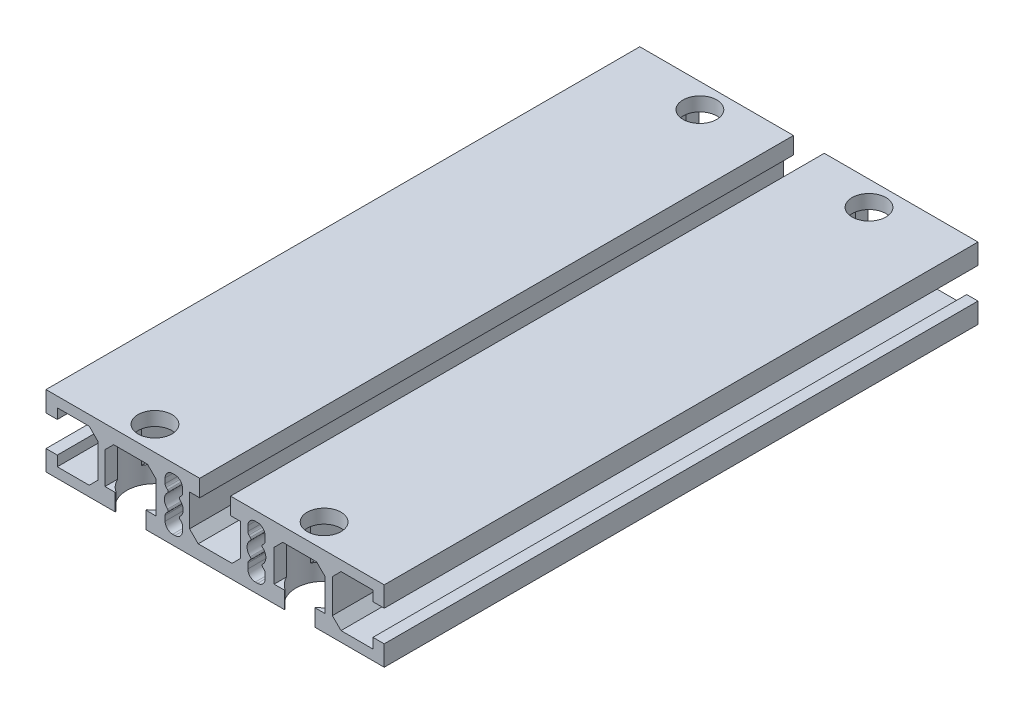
from build123d import *

# Parameters (mm, degrees)
BOSS_EXTRUDE1_DEPTH                     = 79
BOSS_EXTRUDE1_DEPTH_BACK                = 79
CBORE_FOR_M8_HEX_HEAD_BOLT1_D           = 9
CBORE_FOR_M8_HEX_HEAD_BOLT1_CBORE_D     = 15
CBORE_FOR_M8_HEX_HEAD_BOLT1_CBORE_DEPTH = 15.3


with BuildPart() as part:
    # Sketch1 → Boss-Extrude1 (new, two sides: drawn at the far end of the back side and taken through both)
    with BuildSketch(Plane.XY.offset(-BOSS_EXTRUDE1_DEPTH_BACK)):
        Polygon((-15.7, 3.5), (-15.7, -5), (-18.4, -5), (-18.4, -9.5), (18.4, -9.5), (18.4, -5), (15.7, -5), (15.7, 3.5), (18, 5.8), (27, 5.8), (29.3, 3.5), (29.3, -5), (26.6, -5), (26.6, -9.5), (45, -9.5), (45, -4.1), (42, -4.1), (42, -6.8), (33.5, -6.8), (31.2, -4.5), (31.2, 4.5), (33.5, 6.8), (42, 6.8), (42, 4.1), (45, 4.1), (45, 9.5), (4.1, 9.5), (4.1, 5), (6.8, 5), (6.8, -3.5), (4.5, -5.8), (-4.5, -5.8), (-6.8, -3.5), (-6.8, 5), (-4.1, 5), (-4.1, 9.5), (-45, 9.5), (-45, 4.1), (-42, 4.1), (-42, 6.8), (-33.5, 6.8), (-31.2, 4.5), (-31.2, -4.5), (-33.5, -6.8), (-42, -6.8), (-42, -4.1), (-45, -4.1), (-45, -9.5), (-26.6, -9.5), (-26.6, -5), (-29.3, -5), (-29.3, 3.5), (-27, 5.8), (-18, 5.8), align=None)
        with BuildLine():
            Line((-13.299970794, -4.999975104), (-13.299970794, -3.657373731))
            ThreePointArc((-13.299970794, -3.657373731), (-13.223850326, -3.274690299), (-13.007077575, -2.95026695))
            Line((-13.007077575, -2.95026695), (-12.646417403, -2.589606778))
            ThreePointArc((-12.646417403, -2.589606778), (-12.500164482, -2.222137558), (-12.66663746, -1.863375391))
            ThreePointArc((-12.66663746, -1.863375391), (-13.499970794, 1.459e-05), (-12.66663746, 1.863404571))
            ThreePointArc((-12.66663746, 1.863404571), (-12.500164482, 2.222166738), (-12.646417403, 2.589635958))
            Line((-12.646417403, 2.589635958), (-13.007077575, 2.95029613))
            ThreePointArc((-13.007077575, 2.95029613), (-13.223850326, 3.274719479), (-13.299970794, 3.657402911))
            Line((-13.299970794, 3.657402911), (-13.299970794, 5.000004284))
            ThreePointArc((-13.299970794, 5.000004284), (-12.714184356, 6.414217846), (-11.299970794, 7.000004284))
            Line((-11.299970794, 7.000004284), (-10.699970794, 7.000004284))
            ThreePointArc((-10.699970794, 7.000004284), (-9.285757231, 6.414217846), (-8.699970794, 5.000004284))
            Line((-8.699970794, 5.000004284), (-8.699970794, 3.657402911))
            ThreePointArc((-8.699970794, 3.657402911), (-8.776091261, 3.274719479), (-8.992864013, 2.95029613))
            Line((-8.992864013, 2.95029613), (-9.353524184, 2.589635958))
            ThreePointArc((-9.353524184, 2.589635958), (-9.499777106, 2.222166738), (-9.333304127, 1.863404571))
            ThreePointArc((-9.333304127, 1.863404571), (-8.499970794, 1.459e-05), (-9.333304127, -1.863375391))
            ThreePointArc((-9.333304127, -1.863375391), (-9.499777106, -2.222137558), (-9.353524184, -2.589606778))
            Line((-9.353524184, -2.589606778), (-8.992864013, -2.95026695))
            ThreePointArc((-8.992864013, -2.95026695), (-8.776091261, -3.274690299), (-8.699970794, -3.657373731))
            Line((-8.699970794, -3.657373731), (-8.699970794, -4.999975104))
            ThreePointArc((-8.699970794, -4.999975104), (-9.285757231, -6.414188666), (-10.699970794, -6.999975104))
            Line((-10.699970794, -6.999975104), (-11.299970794, -6.999975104))
            ThreePointArc((-11.299970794, -6.999975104), (-12.714184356, -6.414188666), (-13.299970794, -4.999975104))
        make_face(mode=Mode.SUBTRACT)
        with BuildLine():
            Line((13.007077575, 2.95029613), (12.646417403, 2.589635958))
            ThreePointArc((12.646417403, 2.589635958), (12.500164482, 2.222166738), (12.66663746, 1.863404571))
            ThreePointArc((12.66663746, 1.863404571), (13.499970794, 1.459e-05), (12.66663746, -1.863375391))
            ThreePointArc((12.66663746, -1.863375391), (12.500164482, -2.222137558), (12.646417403, -2.589606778))
            Line((12.646417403, -2.589606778), (13.007077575, -2.95026695))
            ThreePointArc((13.007077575, -2.95026695), (13.223850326, -3.274690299), (13.299970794, -3.657373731))
            Line((13.299970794, -3.657373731), (13.299970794, -4.999975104))
            ThreePointArc((13.299970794, -4.999975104), (12.714184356, -6.414188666), (11.299970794, -6.999975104))
            Line((11.299970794, -6.999975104), (10.699970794, -6.999975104))
            ThreePointArc((10.699970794, -6.999975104), (9.285757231, -6.414188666), (8.699970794, -4.999975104))
            Line((8.699970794, -4.999975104), (8.699970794, -3.657373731))
            ThreePointArc((8.699970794, -3.657373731), (8.776091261, -3.274690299), (8.992864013, -2.95026695))
            Line((8.992864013, -2.95026695), (9.353524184, -2.589606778))
            ThreePointArc((9.353524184, -2.589606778), (9.499777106, -2.222137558), (9.333304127, -1.863375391))
            ThreePointArc((9.333304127, -1.863375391), (8.499970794, 1.459e-05), (9.333304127, 1.863404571))
            ThreePointArc((9.333304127, 1.863404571), (9.499777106, 2.222166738), (9.353524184, 2.589635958))
            Line((9.353524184, 2.589635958), (8.992864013, 2.95029613))
            ThreePointArc((8.992864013, 2.95029613), (8.776091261, 3.274719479), (8.699970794, 3.657402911))
            Line((8.699970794, 3.657402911), (8.699970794, 5.000004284))
            ThreePointArc((8.699970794, 5.000004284), (9.285757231, 6.414217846), (10.699970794, 7.000004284))
            Line((10.699970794, 7.000004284), (11.299970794, 7.000004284))
            ThreePointArc((11.299970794, 7.000004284), (12.714184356, 6.414217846), (13.299970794, 5.000004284))
            Line((13.299970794, 5.000004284), (13.299970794, 3.657402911))
            ThreePointArc((13.299970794, 3.657402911), (13.223850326, 3.274719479), (13.007077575, 2.95029613))
        make_face(mode=Mode.SUBTRACT)
    extrude(amount=BOSS_EXTRUDE1_DEPTH + BOSS_EXTRUDE1_DEPTH_BACK)

    # CBORE for M8 Hex Head Bolt1 (through all)
    with Locations(Plane.XZ.offset(9.5)):
        with Locations((-22.5, 72.5), (-22.5, -72.5), (22.5, -72.5), (22.5, 72.5)):
            CounterBoreHole(CBORE_FOR_M8_HEX_HEAD_BOLT1_D / 2, CBORE_FOR_M8_HEX_HEAD_BOLT1_CBORE_D / 2, CBORE_FOR_M8_HEX_HEAD_BOLT1_CBORE_DEPTH)


solid = part.part
